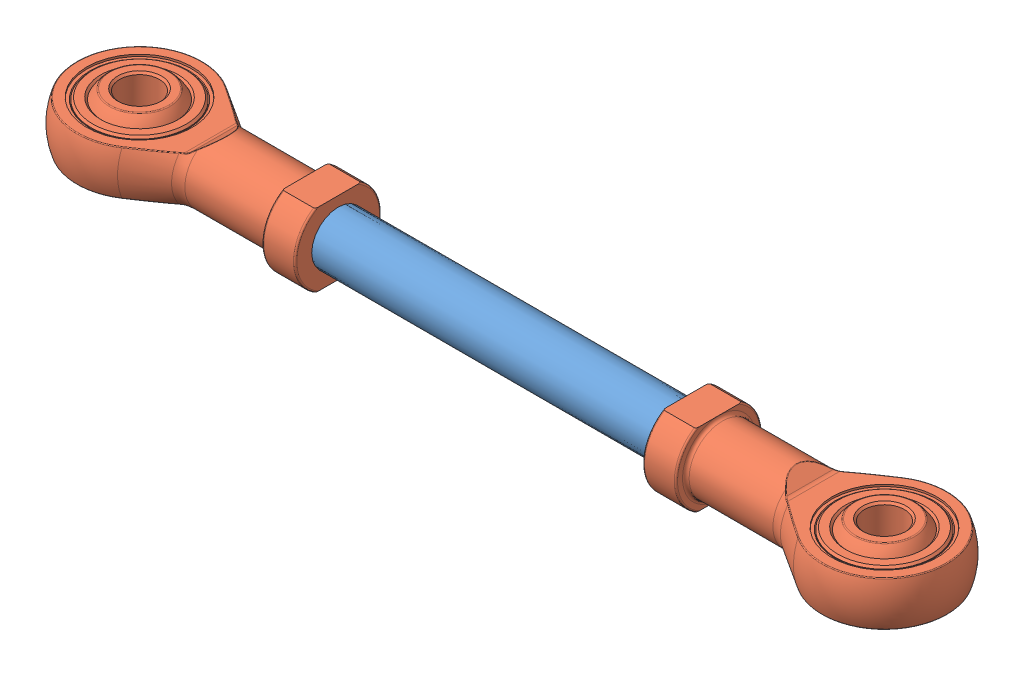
SolidWorks assembly NOVA-bielle tangage.SLDASM, configuration Défaut (file format 6000). Lengths in mm.
Overall size (132.5 11 20).
3 component instances, 2 part files, 4 mates.
Components (placement in the parent):
- NOVA-Bielle tangage-1: NOVA-Bielle tangage.SLDPRT [Défaut] at origin size (72.5 8 8)
- STD-CFF.00.06RH-1: STD-CFF.00.06RH.SLDPRT [Défaut] at (56.25 0 0) x (0 -1 0) z (0 0 1) size (11 40.05 20)
- STD-CFF.00.06RH-2: STD-CFF.00.06RH.SLDPRT [Défaut] at (-56.25 0 0) x (0 1 0) z (0 0 1) size (11 40.05 20)
Mates (geometry in assembly coordinates):
- Coaxiale1: concentric anti-aligned: cylinder of NOVA-Bielle tangage-1 through (-36.25 0 0) axis (-1 0 0) radius 4; cylinder of STD-CFF.00.06RH-1 through (66.25 0 0) axis (1 0 0) radius 5
- Coaxiale2: concentric aligned: cylinder of NOVA-Bielle tangage-1 through (-36.25 0 0) axis (-1 0 0) radius 4; cylinder of STD-CFF.00.06RH-2 through (-66.25 0 0) axis (-1 0 0) radius 5
- Coïncidente1: coincident anti-aligned: plane of NOVA-Bielle tangage-1 through (-26.25 3 0) normal (-1 0 0); plane of STD-CFF.00.06RH-2 through (-26.25 -6.25 0) normal (1 0 0)
- Coïncidente2: coincident anti-aligned: plane of NOVA-Bielle tangage-1 through (26.25 3 0) normal (1 0 0); plane of STD-CFF.00.06RH-1 through (26.25 6.25 0) normal (-1 0 0)
